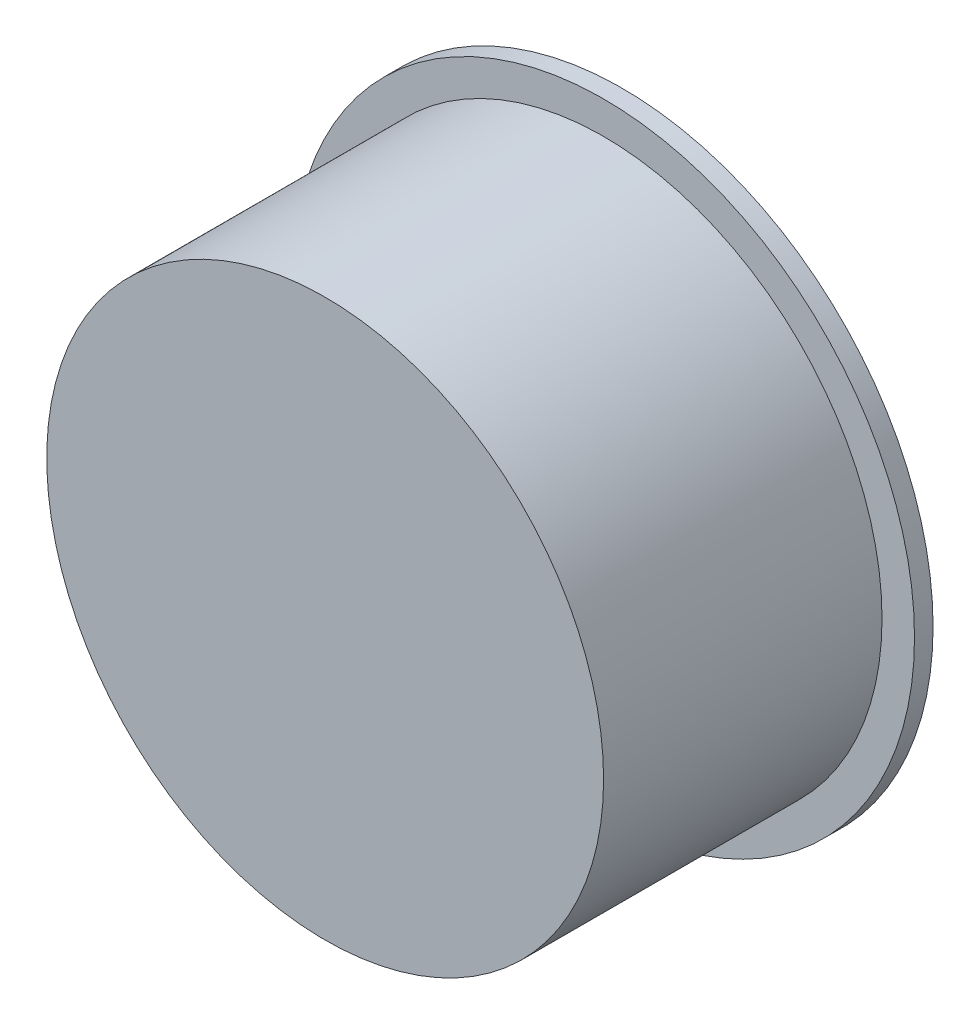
ISO-10303-21;
HEADER;
FILE_DESCRIPTION(('STEP AP214'),'2;1');
FILE_NAME('part.step','',(''),(''),'','','');
FILE_SCHEMA(('AUTOMOTIVE_DESIGN { 1 0 10303 214 1 1 1 1 }'));
ENDSEC;
DATA;
#1=APPLICATION_CONTEXT('core data for automotive mechanical design processes');
#2=APPLICATION_PROTOCOL_DEFINITION('international standard','automotive_design',2000,#1);
#3=PRODUCT_CONTEXT('',#1,'mechanical');
#4=PRODUCT('Part','Part','',(#3));
#5=PRODUCT_RELATED_PRODUCT_CATEGORY('part','',(#4));
#6=PRODUCT_DEFINITION_FORMATION('','',#4);
#7=PRODUCT_DEFINITION_CONTEXT('part definition',#1,'design');
#8=PRODUCT_DEFINITION('design','',#6,#7);
#9=PRODUCT_DEFINITION_SHAPE('','',#8);
#10=(LENGTH_UNIT() NAMED_UNIT(*) SI_UNIT(.MILLI.,.METRE.));
#11=(NAMED_UNIT(*) PLANE_ANGLE_UNIT() SI_UNIT($,.RADIAN.));
#12=(NAMED_UNIT(*) SI_UNIT($,.STERADIAN.) SOLID_ANGLE_UNIT());
#13=UNCERTAINTY_MEASURE_WITH_UNIT(LENGTH_MEASURE(1.E-05),#10,'distance_accuracy_value','');
#14=(GEOMETRIC_REPRESENTATION_CONTEXT(3) GLOBAL_UNCERTAINTY_ASSIGNED_CONTEXT((#13)) GLOBAL_UNIT_ASSIGNED_CONTEXT((#10,
#11,#12)) REPRESENTATION_CONTEXT('',''));
#15=CARTESIAN_POINT('',(0.,0.,0.));
#16=DIRECTION('',(0.,0.,1.));
#17=DIRECTION('',(1.,0.,0.));
#18=AXIS2_PLACEMENT_3D('',#15,#16,#17);
#19=CARTESIAN_POINT('',(0.,0.,-75.7817459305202));
#20=DIRECTION('',(0.,0.,1.));
#21=DIRECTION('',(1.,0.,0.));
#22=AXIS2_PLACEMENT_3D('',#19,#20,#21);
#23=CYLINDRICAL_SURFACE('',#22,27.5);
#24=CARTESIAN_POINT('',(0.,0.,2.));
#25=DIRECTION('',(0.,0.,1.));
#26=DIRECTION('',(1.,0.,0.));
#27=AXIS2_PLACEMENT_3D('',#24,#25,#26);
#28=CIRCLE('',#27,27.5);
#29=CARTESIAN_POINT('',(27.5,0.,2.));
#30=VERTEX_POINT('',#29);
#31=EDGE_CURVE('E112',#30,#30,#28,.F.);
#32=ORIENTED_EDGE('',*,*,#31,.T.);
#33=EDGE_LOOP('',(#32));
#34=FACE_BOUND('',#33,.T.);
#35=CARTESIAN_POINT('',(0.,0.,30.));
#36=DIRECTION('',(0.,0.,1.));
#37=DIRECTION('',(1.,0.,0.));
#38=AXIS2_PLACEMENT_3D('',#35,#36,#37);
#39=CIRCLE('',#38,27.5);
#40=CARTESIAN_POINT('',(27.5,0.,30.));
#41=VERTEX_POINT('',#40);
#42=EDGE_CURVE('E48',#41,#41,#39,.F.);
#43=ORIENTED_EDGE('',*,*,#42,.F.);
#44=EDGE_LOOP('',(#43));
#45=FACE_BOUND('',#44,.T.);
#46=ADVANCED_FACE('F39',(#34,#45),#23,.F.);
#47=CARTESIAN_POINT('',(0.,0.,2.));
#48=DIRECTION('',(0.,0.,-1.));
#49=DIRECTION('',(-1.,0.,0.));
#50=AXIS2_PLACEMENT_3D('',#47,#48,#49);
#51=CYLINDRICAL_SURFACE('',#50,33.5);
#52=CARTESIAN_POINT('',(0.,0.,2.));
#53=DIRECTION('',(0.,0.,1.));
#54=DIRECTION('',(1.,0.,0.));
#55=AXIS2_PLACEMENT_3D('',#52,#53,#54);
#56=CIRCLE('',#55,33.5);
#57=CARTESIAN_POINT('',(33.5,0.,2.));
#58=VERTEX_POINT('',#57);
#59=EDGE_CURVE('E130',#58,#58,#56,.T.);
#60=ORIENTED_EDGE('',*,*,#59,.F.);
#61=EDGE_LOOP('',(#60));
#62=FACE_BOUND('',#61,.T.);
#63=CARTESIAN_POINT('',(0.,0.,0.));
#64=DIRECTION('',(0.,0.,1.));
#65=DIRECTION('',(1.,0.,0.));
#66=AXIS2_PLACEMENT_3D('',#63,#64,#65);
#67=CIRCLE('',#66,33.5);
#68=CARTESIAN_POINT('',(33.5,0.,0.));
#69=VERTEX_POINT('',#68);
#70=EDGE_CURVE('E124',#69,#69,#67,.T.);
#71=ORIENTED_EDGE('',*,*,#70,.T.);
#72=EDGE_LOOP('',(#71));
#73=FACE_BOUND('',#72,.T.);
#74=ADVANCED_FACE('F41',(#62,#73),#51,.T.);
#75=CARTESIAN_POINT('',(0.,0.,2.));
#76=DIRECTION('',(0.,0.,1.));
#77=DIRECTION('',(1.,0.,0.));
#78=AXIS2_PLACEMENT_3D('',#75,#76,#77);
#79=PLANE('',#78);
#80=CARTESIAN_POINT('',(0.,0.,2.));
#81=DIRECTION('',(0.,0.,1.));
#82=DIRECTION('',(1.,0.,0.));
#83=AXIS2_PLACEMENT_3D('',#80,#81,#82);
#84=CIRCLE('',#83,30.);
#85=CARTESIAN_POINT('',(30.,0.,2.));
#86=VERTEX_POINT('',#85);
#87=EDGE_CURVE('E125',#86,#86,#84,.T.);
#88=ORIENTED_EDGE('',*,*,#87,.F.);
#89=EDGE_LOOP('',(#88));
#90=FACE_BOUND('',#89,.T.);
#91=ORIENTED_EDGE('',*,*,#59,.T.);
#92=EDGE_LOOP('',(#91));
#93=FACE_BOUND('',#92,.T.);
#94=ADVANCED_FACE('F158',(#90,#93),#79,.T.);
#95=CARTESIAN_POINT('',(0.,0.,0.));
#96=DIRECTION('',(0.,0.,1.));
#97=DIRECTION('',(1.,0.,0.));
#98=AXIS2_PLACEMENT_3D('',#95,#96,#97);
#99=PLANE('',#98);
#100=DIRECTION('',(0.,1.,0.));
#101=VECTOR('',#100,1.);
#102=CARTESIAN_POINT('',(-5.45076599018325,-7.14970603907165,0.));
#103=LINE('',#102,#101);
#104=CARTESIAN_POINT('',(-5.45076599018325,-7.14970603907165,0.));
#105=VERTEX_POINT('',#104);
#106=CARTESIAN_POINT('',(-5.45076599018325,7.14970603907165,0.));
#107=VERTEX_POINT('',#106);
#108=EDGE_CURVE('E94',#105,#107,#103,.T.);
#109=ORIENTED_EDGE('',*,*,#108,.F.);
#110=CARTESIAN_POINT('',(0.,-7.14970603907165,0.));
#111=DIRECTION('',(0.,0.,-1.));
#112=DIRECTION('',(-1.,0.,0.));
#113=AXIS2_PLACEMENT_3D('',#110,#111,#112);
#114=CIRCLE('',#113,5.45076599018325);
#115=CARTESIAN_POINT('',(5.45076599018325,-7.14970603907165,0.));
#116=VERTEX_POINT('',#115);
#117=EDGE_CURVE('E55',#116,#105,#114,.T.);
#118=ORIENTED_EDGE('',*,*,#117,.F.);
#119=DIRECTION('',(0.,-1.,0.));
#120=VECTOR('',#119,1.);
#121=CARTESIAN_POINT('',(5.45076599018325,-7.14970603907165,0.));
#122=LINE('',#121,#120);
#123=CARTESIAN_POINT('',(5.45076599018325,7.14970603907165,0.));
#124=VERTEX_POINT('',#123);
#125=EDGE_CURVE('E102',#124,#116,#122,.T.);
#126=ORIENTED_EDGE('',*,*,#125,.F.);
#127=CARTESIAN_POINT('',(0.,7.14970603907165,0.));
#128=DIRECTION('',(0.,0.,-1.));
#129=DIRECTION('',(-1.,0.,0.));
#130=AXIS2_PLACEMENT_3D('',#127,#128,#129);
#131=CIRCLE('',#130,5.45076599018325);
#132=EDGE_CURVE('E84',#107,#124,#131,.T.);
#133=ORIENTED_EDGE('',*,*,#132,.F.);
#134=EDGE_LOOP('',(#109,#118,#126,#133));
#135=FACE_BOUND('',#134,.T.);
#136=ORIENTED_EDGE('',*,*,#70,.F.);
#137=EDGE_LOOP('',(#136));
#138=FACE_BOUND('',#137,.T.);
#139=ADVANCED_FACE('F99',(#135,#138),#99,.F.);
#140=CARTESIAN_POINT('',(0.,0.,32.));
#141=DIRECTION('',(0.,0.,-1.));
#142=DIRECTION('',(-1.,0.,0.));
#143=AXIS2_PLACEMENT_3D('',#140,#141,#142);
#144=CYLINDRICAL_SURFACE('',#143,30.);
#145=CARTESIAN_POINT('',(0.,0.,32.));
#146=DIRECTION('',(0.,0.,1.));
#147=DIRECTION('',(1.,0.,0.));
#148=AXIS2_PLACEMENT_3D('',#145,#146,#147);
#149=CIRCLE('',#148,30.);
#150=CARTESIAN_POINT('',(30.,0.,32.));
#151=VERTEX_POINT('',#150);
#152=EDGE_CURVE('E120',#151,#151,#149,.T.);
#153=ORIENTED_EDGE('',*,*,#152,.F.);
#154=EDGE_LOOP('',(#153));
#155=FACE_BOUND('',#154,.T.);
#156=ORIENTED_EDGE('',*,*,#87,.T.);
#157=EDGE_LOOP('',(#156));
#158=FACE_BOUND('',#157,.T.);
#159=ADVANCED_FACE('F167',(#155,#158),#144,.T.);
#160=CARTESIAN_POINT('',(0.,0.,32.));
#161=DIRECTION('',(0.,0.,1.));
#162=DIRECTION('',(1.,0.,0.));
#163=AXIS2_PLACEMENT_3D('',#160,#161,#162);
#164=PLANE('',#163);
#165=ORIENTED_EDGE('',*,*,#152,.T.);
#166=EDGE_LOOP('',(#165));
#167=FACE_BOUND('',#166,.T.);
#168=ADVANCED_FACE('F164',(#167),#164,.T.);
#169=CARTESIAN_POINT('',(0.,0.,2.));
#170=DIRECTION('',(0.,0.,1.));
#171=DIRECTION('',(1.,0.,0.));
#172=AXIS2_PLACEMENT_3D('',#169,#170,#171);
#173=PLANE('',#172);
#174=CARTESIAN_POINT('',(0.,-7.14970603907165,2.));
#175=DIRECTION('',(0.,0.,1.));
#176=DIRECTION('',(1.,0.,0.));
#177=AXIS2_PLACEMENT_3D('',#174,#175,#176);
#178=CIRCLE('',#177,5.45076599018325);
#179=CARTESIAN_POINT('',(-5.45076599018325,-7.14970603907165,2.));
#180=VERTEX_POINT('',#179);
#181=CARTESIAN_POINT('',(5.45076599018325,-7.14970603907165,2.));
#182=VERTEX_POINT('',#181);
#183=EDGE_CURVE('E144',#180,#182,#178,.T.);
#184=ORIENTED_EDGE('',*,*,#183,.F.);
#185=DIRECTION('',(0.,-1.,0.));
#186=VECTOR('',#185,1.);
#187=CARTESIAN_POINT('',(-5.45076599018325,0.,2.));
#188=LINE('',#187,#186);
#189=CARTESIAN_POINT('',(-5.45076599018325,7.14970603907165,2.));
#190=VERTEX_POINT('',#189);
#191=EDGE_CURVE('E129',#190,#180,#188,.T.);
#192=ORIENTED_EDGE('',*,*,#191,.F.);
#193=CARTESIAN_POINT('',(0.,7.14970603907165,2.));
#194=DIRECTION('',(0.,0.,1.));
#195=DIRECTION('',(1.,0.,0.));
#196=AXIS2_PLACEMENT_3D('',#193,#194,#195);
#197=CIRCLE('',#196,5.45076599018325);
#198=CARTESIAN_POINT('',(5.45076599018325,7.14970603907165,2.));
#199=VERTEX_POINT('',#198);
#200=EDGE_CURVE('E87',#199,#190,#197,.T.);
#201=ORIENTED_EDGE('',*,*,#200,.F.);
#202=DIRECTION('',(0.,1.,0.));
#203=VECTOR('',#202,1.);
#204=CARTESIAN_POINT('',(5.45076599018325,0.,2.));
#205=LINE('',#204,#203);
#206=EDGE_CURVE('E141',#182,#199,#205,.T.);
#207=ORIENTED_EDGE('',*,*,#206,.F.);
#208=EDGE_LOOP('',(#184,#192,#201,#207));
#209=FACE_BOUND('',#208,.T.);
#210=ORIENTED_EDGE('',*,*,#31,.F.);
#211=EDGE_LOOP('',(#210));
#212=FACE_BOUND('',#211,.T.);
#213=ADVANCED_FACE('F162',(#209,#212),#173,.T.);
#214=CARTESIAN_POINT('',(0.,-7.14970603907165,3.99999999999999));
#215=DIRECTION('',(0.,0.,-1.));
#216=DIRECTION('',(-1.,0.,0.));
#217=AXIS2_PLACEMENT_3D('',#214,#215,#216);
#218=CYLINDRICAL_SURFACE('',#217,5.45076599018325);
#219=ORIENTED_EDGE('',*,*,#183,.T.);
#220=DIRECTION('',(0.,0.,-1.));
#221=VECTOR('',#220,1.);
#222=CARTESIAN_POINT('',(5.45076599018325,-7.14970603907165,3.99999999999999));
#223=LINE('',#222,#221);
#224=EDGE_CURVE('E109',#182,#116,#223,.T.);
#225=ORIENTED_EDGE('',*,*,#224,.T.);
#226=ORIENTED_EDGE('',*,*,#117,.T.);
#227=DIRECTION('',(0.,0.,-1.));
#228=VECTOR('',#227,1.);
#229=CARTESIAN_POINT('',(-5.45076599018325,-7.14970603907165,3.99999999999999));
#230=LINE('',#229,#228);
#231=EDGE_CURVE('E91',#180,#105,#230,.T.);
#232=ORIENTED_EDGE('',*,*,#231,.F.);
#233=EDGE_LOOP('',(#219,#225,#226,#232));
#234=FACE_BOUND('',#233,.T.);
#235=ADVANCED_FACE('F194',(#234),#218,.F.);
#236=CARTESIAN_POINT('',(5.45076599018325,-7.14970603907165,3.99999999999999));
#237=DIRECTION('',(1.,0.,0.));
#238=DIRECTION('',(0.,0.,-1.));
#239=AXIS2_PLACEMENT_3D('',#236,#237,#238);
#240=PLANE('',#239);
#241=ORIENTED_EDGE('',*,*,#206,.T.);
#242=DIRECTION('',(0.,0.,-1.));
#243=VECTOR('',#242,1.);
#244=CARTESIAN_POINT('',(5.45076599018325,7.14970603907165,3.99999999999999));
#245=LINE('',#244,#243);
#246=EDGE_CURVE('E90',#199,#124,#245,.T.);
#247=ORIENTED_EDGE('',*,*,#246,.T.);
#248=ORIENTED_EDGE('',*,*,#125,.T.);
#249=ORIENTED_EDGE('',*,*,#224,.F.);
#250=EDGE_LOOP('',(#241,#247,#248,#249));
#251=FACE_BOUND('',#250,.T.);
#252=ADVANCED_FACE('F201',(#251),#240,.F.);
#253=CARTESIAN_POINT('',(0.,7.14970603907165,3.99999999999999));
#254=DIRECTION('',(0.,0.,-1.));
#255=DIRECTION('',(-1.,0.,0.));
#256=AXIS2_PLACEMENT_3D('',#253,#254,#255);
#257=CYLINDRICAL_SURFACE('',#256,5.45076599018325);
#258=ORIENTED_EDGE('',*,*,#200,.T.);
#259=DIRECTION('',(0.,0.,-1.));
#260=VECTOR('',#259,1.);
#261=CARTESIAN_POINT('',(-5.45076599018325,7.14970603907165,3.99999999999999));
#262=LINE('',#261,#260);
#263=EDGE_CURVE('E63',#190,#107,#262,.T.);
#264=ORIENTED_EDGE('',*,*,#263,.T.);
#265=ORIENTED_EDGE('',*,*,#132,.T.);
#266=ORIENTED_EDGE('',*,*,#246,.F.);
#267=EDGE_LOOP('',(#258,#264,#265,#266));
#268=FACE_BOUND('',#267,.T.);
#269=ADVANCED_FACE('F81',(#268),#257,.F.);
#270=CARTESIAN_POINT('',(-5.45076599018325,-7.14970603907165,3.99999999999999));
#271=DIRECTION('',(-1.,0.,0.));
#272=DIRECTION('',(0.,0.,1.));
#273=AXIS2_PLACEMENT_3D('',#270,#271,#272);
#274=PLANE('',#273);
#275=ORIENTED_EDGE('',*,*,#191,.T.);
#276=ORIENTED_EDGE('',*,*,#231,.T.);
#277=ORIENTED_EDGE('',*,*,#108,.T.);
#278=ORIENTED_EDGE('',*,*,#263,.F.);
#279=EDGE_LOOP('',(#275,#276,#277,#278));
#280=FACE_BOUND('',#279,.T.);
#281=ADVANCED_FACE('F95',(#280),#274,.F.);
#282=CARTESIAN_POINT('',(0.,0.,30.));
#283=DIRECTION('',(0.,0.,1.));
#284=DIRECTION('',(1.,0.,0.));
#285=AXIS2_PLACEMENT_3D('',#282,#283,#284);
#286=PLANE('',#285);
#287=CARTESIAN_POINT('',(0.,0.,30.));
#288=DIRECTION('',(0.,0.,1.));
#289=DIRECTION('',(1.,0.,0.));
#290=AXIS2_PLACEMENT_3D('',#287,#288,#289);
#291=CIRCLE('',#290,7.5);
#292=CARTESIAN_POINT('',(7.5,0.,30.));
#293=VERTEX_POINT('',#292);
#294=EDGE_CURVE('E11',#293,#293,#291,.F.);
#295=ORIENTED_EDGE('',*,*,#294,.F.);
#296=EDGE_LOOP('',(#295));
#297=FACE_BOUND('',#296,.T.);
#298=ORIENTED_EDGE('',*,*,#42,.T.);
#299=EDGE_LOOP('',(#298));
#300=FACE_BOUND('',#299,.T.);
#301=ADVANCED_FACE('F150',(#297,#300),#286,.F.);
#302=CARTESIAN_POINT('',(0.,0.,14.));
#303=DIRECTION('',(0.,0.,1.));
#304=DIRECTION('',(1.,0.,0.));
#305=AXIS2_PLACEMENT_3D('',#302,#303,#304);
#306=CYLINDRICAL_SURFACE('',#305,7.5);
#307=CARTESIAN_POINT('',(0.,0.,14.));
#308=DIRECTION('',(0.,0.,-1.));
#309=DIRECTION('',(-1.,0.,0.));
#310=AXIS2_PLACEMENT_3D('',#307,#308,#309);
#311=CIRCLE('',#310,7.5);
#312=CARTESIAN_POINT('',(-7.5,0.,14.));
#313=VERTEX_POINT('',#312);
#314=EDGE_CURVE('E285',#313,#313,#311,.T.);
#315=ORIENTED_EDGE('',*,*,#314,.F.);
#316=EDGE_LOOP('',(#315));
#317=FACE_BOUND('',#316,.T.);
#318=ORIENTED_EDGE('',*,*,#294,.T.);
#319=EDGE_LOOP('',(#318));
#320=FACE_BOUND('',#319,.T.);
#321=ADVANCED_FACE('F225',(#317,#320),#306,.T.);
#322=CARTESIAN_POINT('',(0.,0.,14.));
#323=DIRECTION('',(0.,0.,-1.));
#324=DIRECTION('',(-1.,0.,0.));
#325=AXIS2_PLACEMENT_3D('',#322,#323,#324);
#326=PLANE('',#325);
#327=ORIENTED_EDGE('',*,*,#314,.T.);
#328=EDGE_LOOP('',(#327));
#329=FACE_BOUND('',#328,.T.);
#330=ADVANCED_FACE('F233',(#329),#326,.T.);
#331=CLOSED_SHELL('',(#46,#74,#94,#139,#159,#168,#213,#235,#252,#269,#281,#301,#321,#330));
#332=MANIFOLD_SOLID_BREP('B2',#331);
#333=ADVANCED_BREP_SHAPE_REPRESENTATION('',(#18,#332),#14);
#334=SHAPE_DEFINITION_REPRESENTATION(#9,#333);
ENDSEC;
END-ISO-10303-21;
